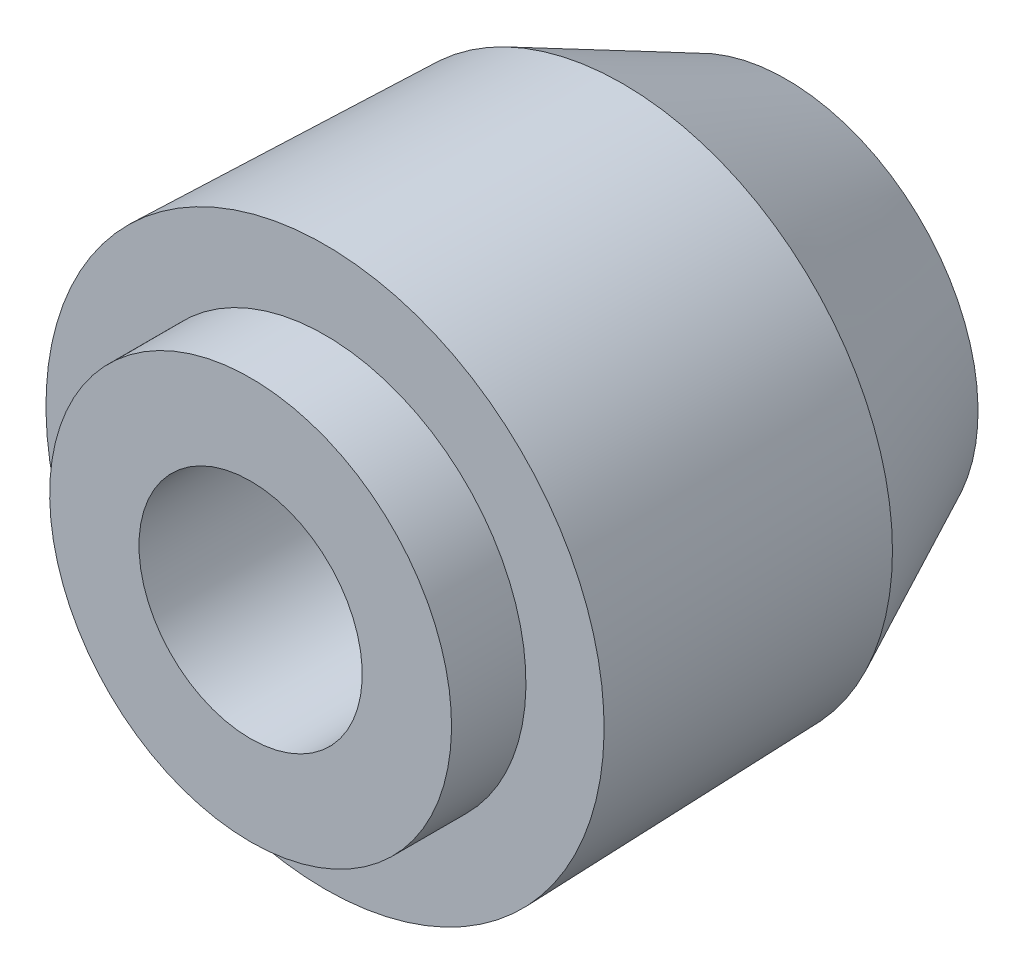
ISO-10303-21;
HEADER;
FILE_DESCRIPTION(('STEP AP214'),'2;1');
FILE_NAME('part.step','',(''),(''),'','','');
FILE_SCHEMA(('AUTOMOTIVE_DESIGN { 1 0 10303 214 1 1 1 1 }'));
ENDSEC;
DATA;
#1=APPLICATION_CONTEXT('core data for automotive mechanical design processes');
#2=APPLICATION_PROTOCOL_DEFINITION('international standard','automotive_design',2000,#1);
#3=PRODUCT_CONTEXT('',#1,'mechanical');
#4=PRODUCT('Part','Part','',(#3));
#5=PRODUCT_RELATED_PRODUCT_CATEGORY('part','',(#4));
#6=PRODUCT_DEFINITION_FORMATION('','',#4);
#7=PRODUCT_DEFINITION_CONTEXT('part definition',#1,'design');
#8=PRODUCT_DEFINITION('design','',#6,#7);
#9=PRODUCT_DEFINITION_SHAPE('','',#8);
#10=(LENGTH_UNIT() NAMED_UNIT(*) SI_UNIT(.MILLI.,.METRE.));
#11=(NAMED_UNIT(*) PLANE_ANGLE_UNIT() SI_UNIT($,.RADIAN.));
#12=(NAMED_UNIT(*) SI_UNIT($,.STERADIAN.) SOLID_ANGLE_UNIT());
#13=UNCERTAINTY_MEASURE_WITH_UNIT(LENGTH_MEASURE(1.E-05),#10,'distance_accuracy_value','');
#14=(GEOMETRIC_REPRESENTATION_CONTEXT(3) GLOBAL_UNCERTAINTY_ASSIGNED_CONTEXT((#13)) GLOBAL_UNIT_ASSIGNED_CONTEXT((#10,
#11,#12)) REPRESENTATION_CONTEXT('',''));
#15=CARTESIAN_POINT('',(0.,0.,0.));
#16=DIRECTION('',(0.,0.,1.));
#17=DIRECTION('',(1.,0.,0.));
#18=AXIS2_PLACEMENT_3D('',#15,#16,#17);
#19=CARTESIAN_POINT('',(3.,0.,14.4));
#20=DIRECTION('',(0.,0.,-1.));
#21=DIRECTION('',(0.,1.,0.));
#22=AXIS2_PLACEMENT_3D('',#19,#20,#21);
#23=PLANE('',#22);
#24=CARTESIAN_POINT('',(0.,0.,14.4));
#25=DIRECTION('',(0.,0.,1.));
#26=DIRECTION('',(0.,-1.,0.));
#27=AXIS2_PLACEMENT_3D('',#24,#25,#26);
#28=CIRCLE('',#27,3.);
#29=CARTESIAN_POINT('',(0.,-3.,14.4));
#30=VERTEX_POINT('',#29);
#31=EDGE_CURVE('E39',#30,#30,#28,.T.);
#32=ORIENTED_EDGE('',*,*,#31,.F.);
#33=EDGE_LOOP('',(#32));
#34=FACE_BOUND('',#33,.T.);
#35=CARTESIAN_POINT('',(0.,0.,14.4));
#36=DIRECTION('',(0.,0.,1.));
#37=DIRECTION('',(0.,-1.,0.));
#38=AXIS2_PLACEMENT_3D('',#35,#36,#37);
#39=CIRCLE('',#38,5.4);
#40=CARTESIAN_POINT('',(0.,-5.4,14.4));
#41=VERTEX_POINT('',#40);
#42=EDGE_CURVE('E15',#41,#41,#39,.F.);
#43=ORIENTED_EDGE('',*,*,#42,.F.);
#44=EDGE_LOOP('',(#43));
#45=FACE_BOUND('',#44,.T.);
#46=ADVANCED_FACE('F12',(#34,#45),#23,.F.);
#47=CARTESIAN_POINT('',(5.15,0.,0.));
#48=DIRECTION('',(0.,0.,1.));
#49=DIRECTION('',(0.,-1.,0.));
#50=AXIS2_PLACEMENT_3D('',#47,#48,#49);
#51=PLANE('',#50);
#52=CARTESIAN_POINT('',(0.,0.,0.));
#53=DIRECTION('',(0.,0.,1.));
#54=DIRECTION('',(0.,-1.,0.));
#55=AXIS2_PLACEMENT_3D('',#52,#53,#54);
#56=CIRCLE('',#55,5.15);
#57=CARTESIAN_POINT('',(0.,-5.15,0.));
#58=VERTEX_POINT('',#57);
#59=EDGE_CURVE('E30',#58,#58,#56,.T.);
#60=ORIENTED_EDGE('',*,*,#59,.F.);
#61=EDGE_LOOP('',(#60));
#62=FACE_BOUND('',#61,.T.);
#63=ADVANCED_FACE('F51',(#62),#51,.F.);
#64=CARTESIAN_POINT('',(0.,0.,0.));
#65=DIRECTION('',(0.,0.,1.));
#66=DIRECTION('',(0.,-1.,0.));
#67=AXIS2_PLACEMENT_3D('',#64,#65,#66);
#68=CYLINDRICAL_SURFACE('',#67,5.4);
#69=ORIENTED_EDGE('',*,*,#42,.T.);
#70=EDGE_LOOP('',(#69));
#71=FACE_BOUND('',#70,.T.);
#72=CARTESIAN_POINT('',(0.,0.,12.4));
#73=DIRECTION('',(0.,0.,1.));
#74=DIRECTION('',(0.,-1.,0.));
#75=AXIS2_PLACEMENT_3D('',#72,#73,#74);
#76=CIRCLE('',#75,5.4);
#77=CARTESIAN_POINT('',(0.,-5.4,12.4));
#78=VERTEX_POINT('',#77);
#79=EDGE_CURVE('E24',#78,#78,#76,.T.);
#80=ORIENTED_EDGE('',*,*,#79,.T.);
#81=EDGE_LOOP('',(#80));
#82=FACE_BOUND('',#81,.T.);
#83=ADVANCED_FACE('F57',(#71,#82),#68,.T.);
#84=CARTESIAN_POINT('',(0.,0.,4.4));
#85=DIRECTION('',(0.,0.,1.));
#86=DIRECTION('',(0.,-1.,0.));
#87=AXIS2_PLACEMENT_3D('',#84,#85,#86);
#88=CONICAL_SURFACE('',#87,7.25,0.445301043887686);
#89=CARTESIAN_POINT('',(0.,0.,4.4));
#90=DIRECTION('',(0.,0.,1.));
#91=DIRECTION('',(0.,-1.,0.));
#92=AXIS2_PLACEMENT_3D('',#89,#90,#91);
#93=CIRCLE('',#92,7.25);
#94=CARTESIAN_POINT('',(0.,-7.25,4.4));
#95=VERTEX_POINT('',#94);
#96=EDGE_CURVE('E19',#95,#95,#93,.T.);
#97=ORIENTED_EDGE('',*,*,#96,.F.);
#98=EDGE_LOOP('',(#97));
#99=FACE_BOUND('',#98,.T.);
#100=ORIENTED_EDGE('',*,*,#59,.T.);
#101=EDGE_LOOP('',(#100));
#102=FACE_BOUND('',#101,.T.);
#103=ADVANCED_FACE('F68',(#99,#102),#88,.T.);
#104=CARTESIAN_POINT('',(5.4,0.,12.4));
#105=DIRECTION('',(0.,0.,-1.));
#106=DIRECTION('',(0.,1.,0.));
#107=AXIS2_PLACEMENT_3D('',#104,#105,#106);
#108=PLANE('',#107);
#109=ORIENTED_EDGE('',*,*,#79,.F.);
#110=EDGE_LOOP('',(#109));
#111=FACE_BOUND('',#110,.T.);
#112=CARTESIAN_POINT('',(0.,0.,12.4));
#113=DIRECTION('',(0.,0.,1.));
#114=DIRECTION('',(0.,-1.,0.));
#115=AXIS2_PLACEMENT_3D('',#112,#113,#114);
#116=CIRCLE('',#115,7.5);
#117=CARTESIAN_POINT('',(0.,-7.5,12.4));
#118=VERTEX_POINT('',#117);
#119=EDGE_CURVE('E8',#118,#118,#116,.F.);
#120=ORIENTED_EDGE('',*,*,#119,.F.);
#121=EDGE_LOOP('',(#120));
#122=FACE_BOUND('',#121,.T.);
#123=ADVANCED_FACE('F63',(#111,#122),#108,.F.);
#124=CARTESIAN_POINT('',(0.,0.,12.4));
#125=DIRECTION('',(0.,0.,1.));
#126=DIRECTION('',(0.,-1.,0.));
#127=AXIS2_PLACEMENT_3D('',#124,#125,#126);
#128=CONICAL_SURFACE('',#127,7.5,0.0312398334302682);
#129=ORIENTED_EDGE('',*,*,#119,.T.);
#130=EDGE_LOOP('',(#129));
#131=FACE_BOUND('',#130,.T.);
#132=ORIENTED_EDGE('',*,*,#96,.T.);
#133=EDGE_LOOP('',(#132));
#134=FACE_BOUND('',#133,.T.);
#135=ADVANCED_FACE('F60',(#131,#134),#128,.T.);
#136=CARTESIAN_POINT('',(0.,0.,8.9));
#137=DIRECTION('',(0.,0.,1.));
#138=DIRECTION('',(0.,-1.,0.));
#139=AXIS2_PLACEMENT_3D('',#136,#137,#138);
#140=PLANE('',#139);
#141=CARTESIAN_POINT('',(0.,0.,8.9));
#142=DIRECTION('',(0.,0.,1.));
#143=DIRECTION('',(0.,-1.,0.));
#144=AXIS2_PLACEMENT_3D('',#141,#142,#143);
#145=CIRCLE('',#144,3.);
#146=CARTESIAN_POINT('',(0.,-3.,8.9));
#147=VERTEX_POINT('',#146);
#148=EDGE_CURVE('E35',#147,#147,#145,.T.);
#149=ORIENTED_EDGE('',*,*,#148,.T.);
#150=EDGE_LOOP('',(#149));
#151=FACE_BOUND('',#150,.T.);
#152=ADVANCED_FACE('F52',(#151),#140,.T.);
#153=CARTESIAN_POINT('',(0.,0.,8.9));
#154=DIRECTION('',(0.,0.,1.));
#155=DIRECTION('',(0.,-1.,0.));
#156=AXIS2_PLACEMENT_3D('',#153,#154,#155);
#157=CYLINDRICAL_SURFACE('',#156,3.);
#158=ORIENTED_EDGE('',*,*,#148,.F.);
#159=EDGE_LOOP('',(#158));
#160=FACE_BOUND('',#159,.T.);
#161=ORIENTED_EDGE('',*,*,#31,.T.);
#162=EDGE_LOOP('',(#161));
#163=FACE_BOUND('',#162,.T.);
#164=ADVANCED_FACE('F47',(#160,#163),#157,.F.);
#165=CLOSED_SHELL('',(#46,#63,#83,#103,#123,#135,#152,#164));
#166=MANIFOLD_SOLID_BREP('B1',#165);
#167=ADVANCED_BREP_SHAPE_REPRESENTATION('',(#18,#166),#14);
#168=SHAPE_DEFINITION_REPRESENTATION(#9,#167);
ENDSEC;
END-ISO-10303-21;
